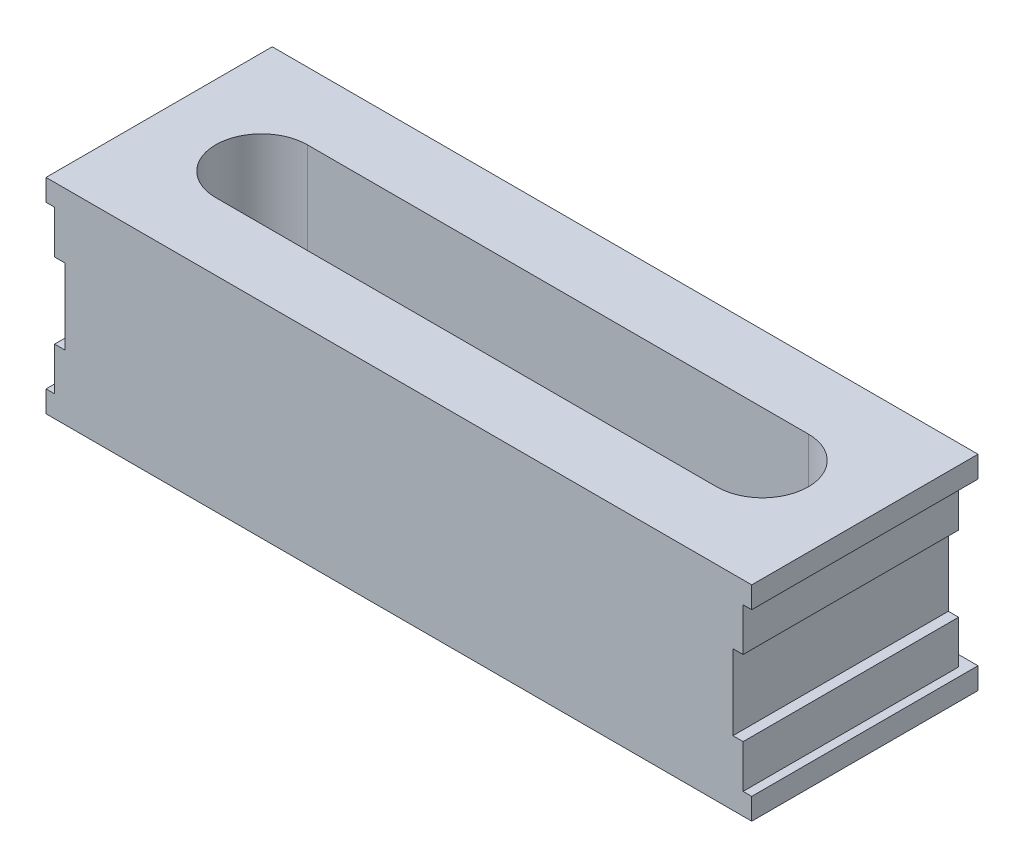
ISO-10303-21;
HEADER;
FILE_DESCRIPTION(('STEP AP214'),'2;1');
FILE_NAME('part.step','',(''),(''),'','','');
FILE_SCHEMA(('AUTOMOTIVE_DESIGN { 1 0 10303 214 1 1 1 1 }'));
ENDSEC;
DATA;
#1=APPLICATION_CONTEXT('core data for automotive mechanical design processes');
#2=APPLICATION_PROTOCOL_DEFINITION('international standard','automotive_design',2000,#1);
#3=PRODUCT_CONTEXT('',#1,'mechanical');
#4=PRODUCT('Part','Part','',(#3));
#5=PRODUCT_RELATED_PRODUCT_CATEGORY('part','',(#4));
#6=PRODUCT_DEFINITION_FORMATION('','',#4);
#7=PRODUCT_DEFINITION_CONTEXT('part definition',#1,'design');
#8=PRODUCT_DEFINITION('design','',#6,#7);
#9=PRODUCT_DEFINITION_SHAPE('','',#8);
#10=(LENGTH_UNIT() NAMED_UNIT(*) SI_UNIT(.MILLI.,.METRE.));
#11=(NAMED_UNIT(*) PLANE_ANGLE_UNIT() SI_UNIT($,.RADIAN.));
#12=(NAMED_UNIT(*) SI_UNIT($,.STERADIAN.) SOLID_ANGLE_UNIT());
#13=UNCERTAINTY_MEASURE_WITH_UNIT(LENGTH_MEASURE(1.E-05),#10,'distance_accuracy_value','');
#14=(GEOMETRIC_REPRESENTATION_CONTEXT(3) GLOBAL_UNCERTAINTY_ASSIGNED_CONTEXT((#13)) GLOBAL_UNIT_ASSIGNED_CONTEXT((#10,
#11,#12)) REPRESENTATION_CONTEXT('',''));
#15=CARTESIAN_POINT('',(0.,0.,0.));
#16=DIRECTION('',(0.,0.,1.));
#17=DIRECTION('',(1.,0.,0.));
#18=AXIS2_PLACEMENT_3D('',#15,#16,#17);
#19=CARTESIAN_POINT('',(-23.25,-8.5,0.));
#20=DIRECTION('',(0.,-1.,0.));
#21=DIRECTION('',(0.,0.,-1.));
#22=AXIS2_PLACEMENT_3D('',#19,#20,#21);
#23=PLANE('',#22);
#24=CARTESIAN_POINT('',(-23.25,-8.5,0.));
#25=DIRECTION('',(0.,-1.,0.));
#26=DIRECTION('',(0.,0.,-1.));
#27=AXIS2_PLACEMENT_3D('',#24,#25,#26);
#28=CIRCLE('',#27,4.25);
#29=CARTESIAN_POINT('',(-23.25,-8.5,4.25));
#30=VERTEX_POINT('',#29);
#31=CARTESIAN_POINT('',(-23.25,-8.5,-4.25));
#32=VERTEX_POINT('',#31);
#33=EDGE_CURVE('E227',#30,#32,#28,.T.);
#34=ORIENTED_EDGE('',*,*,#33,.F.);
#35=DIRECTION('',(-1.,0.,0.));
#36=VECTOR('',#35,1.);
#37=CARTESIAN_POINT('',(-23.25,-8.5,4.25));
#38=LINE('',#37,#36);
#39=CARTESIAN_POINT('',(23.25,-8.5,4.25));
#40=VERTEX_POINT('',#39);
#41=EDGE_CURVE('E222',#40,#30,#38,.T.);
#42=ORIENTED_EDGE('',*,*,#41,.F.);
#43=CARTESIAN_POINT('',(23.25,-8.5,0.));
#44=DIRECTION('',(0.,-1.,0.));
#45=DIRECTION('',(0.,0.,-1.));
#46=AXIS2_PLACEMENT_3D('',#43,#44,#45);
#47=CIRCLE('',#46,4.25);
#48=CARTESIAN_POINT('',(23.25,-8.5,-4.25));
#49=VERTEX_POINT('',#48);
#50=EDGE_CURVE('E24',#49,#40,#47,.T.);
#51=ORIENTED_EDGE('',*,*,#50,.F.);
#52=DIRECTION('',(1.,0.,0.));
#53=VECTOR('',#52,1.);
#54=CARTESIAN_POINT('',(-23.25,-8.5,-4.25));
#55=LINE('',#54,#53);
#56=EDGE_CURVE('E9',#32,#49,#55,.T.);
#57=ORIENTED_EDGE('',*,*,#56,.F.);
#58=EDGE_LOOP('',(#34,#42,#51,#57));
#59=FACE_BOUND('',#58,.T.);
#60=ADVANCED_FACE('F15',(#59),#23,.F.);
#61=CARTESIAN_POINT('',(-23.25,11.5,-4.25));
#62=DIRECTION('',(0.,0.,-1.));
#63=DIRECTION('',(0.,-1.,0.));
#64=AXIS2_PLACEMENT_3D('',#61,#62,#63);
#65=PLANE('',#64);
#66=DIRECTION('',(0.,-1.,0.));
#67=VECTOR('',#66,1.);
#68=CARTESIAN_POINT('',(-23.25,11.5,-4.25));
#69=LINE('',#68,#67);
#70=CARTESIAN_POINT('',(-23.25,9.5,-4.25));
#71=VERTEX_POINT('',#70);
#72=EDGE_CURVE('E231',#71,#32,#69,.T.);
#73=ORIENTED_EDGE('',*,*,#72,.T.);
#74=ORIENTED_EDGE('',*,*,#56,.T.);
#75=DIRECTION('',(0.,-1.,0.));
#76=VECTOR('',#75,1.);
#77=CARTESIAN_POINT('',(23.25,11.5,-4.25));
#78=LINE('',#77,#76);
#79=CARTESIAN_POINT('',(23.25,9.5,-4.25));
#80=VERTEX_POINT('',#79);
#81=EDGE_CURVE('E255',#80,#49,#78,.T.);
#82=ORIENTED_EDGE('',*,*,#81,.F.);
#83=DIRECTION('',(1.,0.,0.));
#84=VECTOR('',#83,1.);
#85=CARTESIAN_POINT('',(-32.75,9.5,-4.25));
#86=LINE('',#85,#84);
#87=EDGE_CURVE('E234',#71,#80,#86,.T.);
#88=ORIENTED_EDGE('',*,*,#87,.F.);
#89=EDGE_LOOP('',(#73,#74,#82,#88));
#90=FACE_BOUND('',#89,.T.);
#91=ADVANCED_FACE('F232',(#90),#65,.F.);
#92=CARTESIAN_POINT('',(23.25,11.5,0.));
#93=DIRECTION('',(0.,-1.,0.));
#94=DIRECTION('',(0.,0.,-1.));
#95=AXIS2_PLACEMENT_3D('',#92,#93,#94);
#96=CYLINDRICAL_SURFACE('',#95,4.25);
#97=ORIENTED_EDGE('',*,*,#81,.T.);
#98=ORIENTED_EDGE('',*,*,#50,.T.);
#99=DIRECTION('',(0.,-1.,0.));
#100=VECTOR('',#99,1.);
#101=CARTESIAN_POINT('',(23.25,11.5,4.25));
#102=LINE('',#101,#100);
#103=CARTESIAN_POINT('',(23.25,9.5,4.25));
#104=VERTEX_POINT('',#103);
#105=EDGE_CURVE('E239',#104,#40,#102,.T.);
#106=ORIENTED_EDGE('',*,*,#105,.F.);
#107=CARTESIAN_POINT('',(23.25,9.5,0.));
#108=DIRECTION('',(0.,-1.,0.));
#109=DIRECTION('',(0.,0.,-1.));
#110=AXIS2_PLACEMENT_3D('',#107,#108,#109);
#111=CIRCLE('',#110,4.25);
#112=EDGE_CURVE('E248',#80,#104,#111,.T.);
#113=ORIENTED_EDGE('',*,*,#112,.F.);
#114=EDGE_LOOP('',(#97,#98,#106,#113));
#115=FACE_BOUND('',#114,.T.);
#116=ADVANCED_FACE('F260',(#115),#96,.F.);
#117=CARTESIAN_POINT('',(-23.25,11.5,4.25));
#118=DIRECTION('',(0.,0.,1.));
#119=DIRECTION('',(1.,0.,0.));
#120=AXIS2_PLACEMENT_3D('',#117,#118,#119);
#121=PLANE('',#120);
#122=ORIENTED_EDGE('',*,*,#105,.T.);
#123=ORIENTED_EDGE('',*,*,#41,.T.);
#124=DIRECTION('',(0.,-1.,0.));
#125=VECTOR('',#124,1.);
#126=CARTESIAN_POINT('',(-23.25,11.5,4.25));
#127=LINE('',#126,#125);
#128=CARTESIAN_POINT('',(-23.25,9.5,4.25));
#129=VERTEX_POINT('',#128);
#130=EDGE_CURVE('E242',#129,#30,#127,.T.);
#131=ORIENTED_EDGE('',*,*,#130,.F.);
#132=DIRECTION('',(-1.,0.,0.));
#133=VECTOR('',#132,1.);
#134=CARTESIAN_POINT('',(-32.75,9.5,4.25));
#135=LINE('',#134,#133);
#136=EDGE_CURVE('E266',#104,#129,#135,.T.);
#137=ORIENTED_EDGE('',*,*,#136,.F.);
#138=EDGE_LOOP('',(#122,#123,#131,#137));
#139=FACE_BOUND('',#138,.T.);
#140=ADVANCED_FACE('F264',(#139),#121,.F.);
#141=CARTESIAN_POINT('',(-23.25,11.5,0.));
#142=DIRECTION('',(0.,-1.,0.));
#143=DIRECTION('',(0.,0.,-1.));
#144=AXIS2_PLACEMENT_3D('',#141,#142,#143);
#145=CYLINDRICAL_SURFACE('',#144,4.25);
#146=ORIENTED_EDGE('',*,*,#130,.T.);
#147=ORIENTED_EDGE('',*,*,#33,.T.);
#148=ORIENTED_EDGE('',*,*,#72,.F.);
#149=CARTESIAN_POINT('',(-23.25,9.5,0.));
#150=DIRECTION('',(0.,-1.,0.));
#151=DIRECTION('',(0.,0.,-1.));
#152=AXIS2_PLACEMENT_3D('',#149,#150,#151);
#153=CIRCLE('',#152,4.25);
#154=EDGE_CURVE('E269',#129,#71,#153,.T.);
#155=ORIENTED_EDGE('',*,*,#154,.F.);
#156=EDGE_LOOP('',(#146,#147,#148,#155));
#157=FACE_BOUND('',#156,.T.);
#158=ADVANCED_FACE('F241',(#157),#145,.F.);
#159=CARTESIAN_POINT('',(-32.75,9.5,10.5));
#160=DIRECTION('',(0.,-1.,0.));
#161=DIRECTION('',(0.,0.,-1.));
#162=AXIS2_PLACEMENT_3D('',#159,#160,#161);
#163=PLANE('',#162);
#164=ORIENTED_EDGE('',*,*,#136,.T.);
#165=ORIENTED_EDGE('',*,*,#154,.T.);
#166=ORIENTED_EDGE('',*,*,#87,.T.);
#167=ORIENTED_EDGE('',*,*,#112,.T.);
#168=EDGE_LOOP('',(#164,#165,#166,#167));
#169=FACE_BOUND('',#168,.T.);
#170=DIRECTION('',(0.,0.,-1.));
#171=VECTOR('',#170,1.);
#172=CARTESIAN_POINT('',(32.75,9.5,10.5));
#173=LINE('',#172,#171);
#174=CARTESIAN_POINT('',(32.75,9.5,10.5));
#175=VERTEX_POINT('',#174);
#176=CARTESIAN_POINT('',(32.75,9.5,-10.5));
#177=VERTEX_POINT('',#176);
#178=EDGE_CURVE('E270',#175,#177,#173,.T.);
#179=ORIENTED_EDGE('',*,*,#178,.T.);
#180=DIRECTION('',(-1.,0.,0.));
#181=VECTOR('',#180,1.);
#182=CARTESIAN_POINT('',(-32.75,9.5,-10.5));
#183=LINE('',#182,#181);
#184=CARTESIAN_POINT('',(-32.75,9.5,-10.5));
#185=VERTEX_POINT('',#184);
#186=EDGE_CURVE('E291',#177,#185,#183,.T.);
#187=ORIENTED_EDGE('',*,*,#186,.T.);
#188=DIRECTION('',(0.,0.,-1.));
#189=VECTOR('',#188,1.);
#190=CARTESIAN_POINT('',(-32.75,9.5,10.5));
#191=LINE('',#190,#189);
#192=CARTESIAN_POINT('',(-32.75,9.5,10.5));
#193=VERTEX_POINT('',#192);
#194=EDGE_CURVE('E310',#193,#185,#191,.T.);
#195=ORIENTED_EDGE('',*,*,#194,.F.);
#196=DIRECTION('',(-1.,0.,0.));
#197=VECTOR('',#196,1.);
#198=CARTESIAN_POINT('',(-32.75,9.5,10.5));
#199=LINE('',#198,#197);
#200=EDGE_CURVE('E404',#175,#193,#199,.T.);
#201=ORIENTED_EDGE('',*,*,#200,.F.);
#202=EDGE_LOOP('',(#179,#187,#195,#201));
#203=FACE_BOUND('',#202,.T.);
#204=ADVANCED_FACE('F604',(#169,#203),#163,.F.);
#205=CARTESIAN_POINT('',(32.75,9.5,10.5));
#206=DIRECTION('',(-1.,0.,0.));
#207=DIRECTION('',(0.,0.,1.));
#208=AXIS2_PLACEMENT_3D('',#205,#206,#207);
#209=PLANE('',#208);
#210=DIRECTION('',(0.,1.,0.));
#211=VECTOR('',#210,1.);
#212=CARTESIAN_POINT('',(32.75,9.5,-10.5));
#213=LINE('',#212,#211);
#214=CARTESIAN_POINT('',(32.75,-9.5,-10.5));
#215=VERTEX_POINT('',#214);
#216=CARTESIAN_POINT('',(32.75,-7.5,-10.5));
#217=VERTEX_POINT('',#216);
#218=EDGE_CURVE('E276',#215,#217,#213,.T.);
#219=ORIENTED_EDGE('',*,*,#218,.T.);
#220=DIRECTION('',(0.,0.,1.));
#221=VECTOR('',#220,1.);
#222=CARTESIAN_POINT('',(32.75,-7.5,-11.5));
#223=LINE('',#222,#221);
#224=CARTESIAN_POINT('',(32.75,-7.5,10.5));
#225=VERTEX_POINT('',#224);
#226=EDGE_CURVE('E491',#217,#225,#223,.T.);
#227=ORIENTED_EDGE('',*,*,#226,.T.);
#228=DIRECTION('',(0.,1.,0.));
#229=VECTOR('',#228,1.);
#230=CARTESIAN_POINT('',(32.75,9.5,10.5));
#231=LINE('',#230,#229);
#232=CARTESIAN_POINT('',(32.75,-9.5,10.5));
#233=VERTEX_POINT('',#232);
#234=EDGE_CURVE('E349',#233,#225,#231,.T.);
#235=ORIENTED_EDGE('',*,*,#234,.F.);
#236=DIRECTION('',(0.,0.,-1.));
#237=VECTOR('',#236,1.);
#238=CARTESIAN_POINT('',(32.75,-9.5,10.5));
#239=LINE('',#238,#237);
#240=EDGE_CURVE('E288',#233,#215,#239,.T.);
#241=ORIENTED_EDGE('',*,*,#240,.T.);
#242=EDGE_LOOP('',(#219,#227,#235,#241));
#243=FACE_BOUND('',#242,.T.);
#244=ADVANCED_FACE('F346',(#243),#209,.F.);
#245=CARTESIAN_POINT('',(32.75,9.5,10.5));
#246=DIRECTION('',(-1.,0.,0.));
#247=DIRECTION('',(0.,0.,1.));
#248=AXIS2_PLACEMENT_3D('',#245,#246,#247);
#249=PLANE('',#248);
#250=DIRECTION('',(0.,1.,0.));
#251=VECTOR('',#250,1.);
#252=CARTESIAN_POINT('',(32.75,9.5,10.5));
#253=LINE('',#252,#251);
#254=CARTESIAN_POINT('',(32.75,7.5,10.5));
#255=VERTEX_POINT('',#254);
#256=EDGE_CURVE('E388',#255,#175,#253,.T.);
#257=ORIENTED_EDGE('',*,*,#256,.F.);
#258=DIRECTION('',(0.,0.,1.));
#259=VECTOR('',#258,1.);
#260=CARTESIAN_POINT('',(32.75,7.5,-11.5));
#261=LINE('',#260,#259);
#262=CARTESIAN_POINT('',(32.75,7.5,-10.5));
#263=VERTEX_POINT('',#262);
#264=EDGE_CURVE('E331',#263,#255,#261,.T.);
#265=ORIENTED_EDGE('',*,*,#264,.F.);
#266=DIRECTION('',(0.,1.,0.));
#267=VECTOR('',#266,1.);
#268=CARTESIAN_POINT('',(32.75,9.5,-10.5));
#269=LINE('',#268,#267);
#270=EDGE_CURVE('E295',#263,#177,#269,.T.);
#271=ORIENTED_EDGE('',*,*,#270,.T.);
#272=ORIENTED_EDGE('',*,*,#178,.F.);
#273=EDGE_LOOP('',(#257,#265,#271,#272));
#274=FACE_BOUND('',#273,.T.);
#275=ADVANCED_FACE('F609',(#274),#249,.F.);
#276=CARTESIAN_POINT('',(-32.75,-9.5,-10.5));
#277=DIRECTION('',(0.,0.,1.));
#278=DIRECTION('',(1.,0.,0.));
#279=AXIS2_PLACEMENT_3D('',#276,#277,#278);
#280=PLANE('',#279);
#281=DIRECTION('',(0.,-1.,0.));
#282=VECTOR('',#281,1.);
#283=CARTESIAN_POINT('',(-32.75,9.5,-10.5));
#284=LINE('',#283,#282);
#285=CARTESIAN_POINT('',(-32.75,-7.5,-10.5));
#286=VERTEX_POINT('',#285);
#287=CARTESIAN_POINT('',(-32.75,-9.5,-10.5));
#288=VERTEX_POINT('',#287);
#289=EDGE_CURVE('E308',#286,#288,#284,.T.);
#290=ORIENTED_EDGE('',*,*,#289,.F.);
#291=DIRECTION('',(1.,0.,0.));
#292=VECTOR('',#291,1.);
#293=CARTESIAN_POINT('',(-32.75,-7.5,-10.5));
#294=LINE('',#293,#292);
#295=EDGE_CURVE('E496',#286,#217,#294,.T.);
#296=ORIENTED_EDGE('',*,*,#295,.T.);
#297=ORIENTED_EDGE('',*,*,#218,.F.);
#298=DIRECTION('',(1.,0.,0.));
#299=VECTOR('',#298,1.);
#300=CARTESIAN_POINT('',(-32.75,-9.5,-10.5));
#301=LINE('',#300,#299);
#302=EDGE_CURVE('E335',#288,#215,#301,.T.);
#303=ORIENTED_EDGE('',*,*,#302,.F.);
#304=EDGE_LOOP('',(#290,#296,#297,#303));
#305=FACE_BOUND('',#304,.T.);
#306=ADVANCED_FACE('F587',(#305),#280,.F.);
#307=CARTESIAN_POINT('',(-32.75,9.5,10.5));
#308=DIRECTION('',(1.,0.,0.));
#309=DIRECTION('',(0.,1.,0.));
#310=AXIS2_PLACEMENT_3D('',#307,#308,#309);
#311=PLANE('',#310);
#312=DIRECTION('',(0.,0.,1.));
#313=VECTOR('',#312,1.);
#314=CARTESIAN_POINT('',(-32.75,7.5,-11.5));
#315=LINE('',#314,#313);
#316=CARTESIAN_POINT('',(-32.75,7.5,-10.5));
#317=VERTEX_POINT('',#316);
#318=CARTESIAN_POINT('',(-32.75,7.5,10.5));
#319=VERTEX_POINT('',#318);
#320=EDGE_CURVE('E505',#317,#319,#315,.T.);
#321=ORIENTED_EDGE('',*,*,#320,.T.);
#322=DIRECTION('',(0.,-1.,0.));
#323=VECTOR('',#322,1.);
#324=CARTESIAN_POINT('',(-32.75,9.5,10.5));
#325=LINE('',#324,#323);
#326=EDGE_CURVE('E423',#193,#319,#325,.T.);
#327=ORIENTED_EDGE('',*,*,#326,.F.);
#328=ORIENTED_EDGE('',*,*,#194,.T.);
#329=DIRECTION('',(0.,-1.,0.));
#330=VECTOR('',#329,1.);
#331=CARTESIAN_POINT('',(-32.75,9.5,-10.5));
#332=LINE('',#331,#330);
#333=EDGE_CURVE('E289',#185,#317,#332,.T.);
#334=ORIENTED_EDGE('',*,*,#333,.T.);
#335=EDGE_LOOP('',(#321,#327,#328,#334));
#336=FACE_BOUND('',#335,.T.);
#337=ADVANCED_FACE('F579',(#336),#311,.F.);
#338=CARTESIAN_POINT('',(-32.75,9.5,10.5));
#339=DIRECTION('',(1.,0.,0.));
#340=DIRECTION('',(0.,1.,0.));
#341=AXIS2_PLACEMENT_3D('',#338,#339,#340);
#342=PLANE('',#341);
#343=DIRECTION('',(0.,0.,1.));
#344=VECTOR('',#343,1.);
#345=CARTESIAN_POINT('',(-32.75,-7.5,-11.5));
#346=LINE('',#345,#344);
#347=CARTESIAN_POINT('',(-32.75,-7.5,10.5));
#348=VERTEX_POINT('',#347);
#349=EDGE_CURVE('E499',#286,#348,#346,.T.);
#350=ORIENTED_EDGE('',*,*,#349,.F.);
#351=ORIENTED_EDGE('',*,*,#289,.T.);
#352=DIRECTION('',(0.,0.,-1.));
#353=VECTOR('',#352,1.);
#354=CARTESIAN_POINT('',(-32.75,-9.5,10.5));
#355=LINE('',#354,#353);
#356=CARTESIAN_POINT('',(-32.75,-9.5,10.5));
#357=VERTEX_POINT('',#356);
#358=EDGE_CURVE('E333',#357,#288,#355,.T.);
#359=ORIENTED_EDGE('',*,*,#358,.F.);
#360=DIRECTION('',(0.,-1.,0.));
#361=VECTOR('',#360,1.);
#362=CARTESIAN_POINT('',(-32.75,9.5,10.5));
#363=LINE('',#362,#361);
#364=EDGE_CURVE('E357',#348,#357,#363,.T.);
#365=ORIENTED_EDGE('',*,*,#364,.F.);
#366=EDGE_LOOP('',(#350,#351,#359,#365));
#367=FACE_BOUND('',#366,.T.);
#368=ADVANCED_FACE('F577',(#367),#342,.F.);
#369=CARTESIAN_POINT('',(-31.95,-5.5,-11.5));
#370=DIRECTION('',(-1.,0.,0.));
#371=DIRECTION('',(0.,0.,1.));
#372=AXIS2_PLACEMENT_3D('',#369,#370,#371);
#373=PLANE('',#372);
#374=DIRECTION('',(0.,0.,1.));
#375=VECTOR('',#374,1.);
#376=CARTESIAN_POINT('',(-31.95,-3.5,-11.5));
#377=LINE('',#376,#375);
#378=CARTESIAN_POINT('',(-31.95,-3.5,-9.5));
#379=VERTEX_POINT('',#378);
#380=CARTESIAN_POINT('',(-31.95,-3.5,10.5));
#381=VERTEX_POINT('',#380);
#382=EDGE_CURVE('E311',#379,#381,#377,.T.);
#383=ORIENTED_EDGE('',*,*,#382,.F.);
#384=DIRECTION('',(0.,-1.,0.));
#385=VECTOR('',#384,1.);
#386=CARTESIAN_POINT('',(-31.95,-5.5,-9.5));
#387=LINE('',#386,#385);
#388=CARTESIAN_POINT('',(-31.95,-7.5,-9.5));
#389=VERTEX_POINT('',#388);
#390=EDGE_CURVE('E478',#379,#389,#387,.T.);
#391=ORIENTED_EDGE('',*,*,#390,.T.);
#392=DIRECTION('',(0.,0.,-1.));
#393=VECTOR('',#392,1.);
#394=CARTESIAN_POINT('',(-31.95,-7.5,10.5));
#395=LINE('',#394,#393);
#396=CARTESIAN_POINT('',(-31.95,-7.5,10.5));
#397=VERTEX_POINT('',#396);
#398=EDGE_CURVE('E485',#397,#389,#395,.T.);
#399=ORIENTED_EDGE('',*,*,#398,.F.);
#400=DIRECTION('',(0.,-1.,0.));
#401=VECTOR('',#400,1.);
#402=CARTESIAN_POINT('',(-31.95,-5.5,10.5));
#403=LINE('',#402,#401);
#404=EDGE_CURVE('E372',#381,#397,#403,.T.);
#405=ORIENTED_EDGE('',*,*,#404,.F.);
#406=EDGE_LOOP('',(#383,#391,#399,#405));
#407=FACE_BOUND('',#406,.T.);
#408=ADVANCED_FACE('F576',(#407),#373,.T.);
#409=CARTESIAN_POINT('',(-31.95,-3.5,-11.5));
#410=DIRECTION('',(0.,1.,0.));
#411=DIRECTION('',(1.,0.,0.));
#412=AXIS2_PLACEMENT_3D('',#409,#410,#411);
#413=PLANE('',#412);
#414=DIRECTION('',(-1.,0.,0.));
#415=VECTOR('',#414,1.);
#416=CARTESIAN_POINT('',(-31.95,-3.5,10.5));
#417=LINE('',#416,#415);
#418=CARTESIAN_POINT('',(-31.,-3.5,10.5));
#419=VERTEX_POINT('',#418);
#420=EDGE_CURVE('E380',#419,#381,#417,.T.);
#421=ORIENTED_EDGE('',*,*,#420,.F.);
#422=DIRECTION('',(0.,0.,1.));
#423=VECTOR('',#422,1.);
#424=CARTESIAN_POINT('',(-31.,-3.5,-10.5));
#425=LINE('',#424,#423);
#426=CARTESIAN_POINT('',(-31.,-3.5,-9.5));
#427=VERTEX_POINT('',#426);
#428=EDGE_CURVE('E307',#427,#419,#425,.T.);
#429=ORIENTED_EDGE('',*,*,#428,.F.);
#430=DIRECTION('',(-1.,0.,0.));
#431=VECTOR('',#430,1.);
#432=CARTESIAN_POINT('',(-31.95,-3.5,-9.5));
#433=LINE('',#432,#431);
#434=EDGE_CURVE('E482',#427,#379,#433,.T.);
#435=ORIENTED_EDGE('',*,*,#434,.T.);
#436=ORIENTED_EDGE('',*,*,#382,.T.);
#437=EDGE_LOOP('',(#421,#429,#435,#436));
#438=FACE_BOUND('',#437,.T.);
#439=ADVANCED_FACE('F574',(#438),#413,.T.);
#440=CARTESIAN_POINT('',(-31.,1.75,-11.5));
#441=DIRECTION('',(-1.,0.,0.));
#442=DIRECTION('',(0.,0.,1.));
#443=AXIS2_PLACEMENT_3D('',#440,#441,#442);
#444=PLANE('',#443);
#445=DIRECTION('',(0.,-1.,0.));
#446=VECTOR('',#445,1.);
#447=CARTESIAN_POINT('',(-31.,1.75,10.5));
#448=LINE('',#447,#446);
#449=CARTESIAN_POINT('',(-31.,3.5,10.5));
#450=VERTEX_POINT('',#449);
#451=EDGE_CURVE('E377',#450,#419,#448,.T.);
#452=ORIENTED_EDGE('',*,*,#451,.F.);
#453=DIRECTION('',(0.,0.,1.));
#454=VECTOR('',#453,1.);
#455=CARTESIAN_POINT('',(-31.,3.5,-10.5));
#456=LINE('',#455,#454);
#457=CARTESIAN_POINT('',(-31.,3.5,-9.5));
#458=VERTEX_POINT('',#457);
#459=EDGE_CURVE('E305',#458,#450,#456,.T.);
#460=ORIENTED_EDGE('',*,*,#459,.F.);
#461=DIRECTION('',(0.,-1.,0.));
#462=VECTOR('',#461,1.);
#463=CARTESIAN_POINT('',(-31.,1.75,-9.5));
#464=LINE('',#463,#462);
#465=EDGE_CURVE('E435',#458,#427,#464,.T.);
#466=ORIENTED_EDGE('',*,*,#465,.T.);
#467=ORIENTED_EDGE('',*,*,#428,.T.);
#468=EDGE_LOOP('',(#452,#460,#466,#467));
#469=FACE_BOUND('',#468,.T.);
#470=ADVANCED_FACE('F572',(#469),#444,.T.);
#471=CARTESIAN_POINT('',(-31.95,3.5,-11.5));
#472=DIRECTION('',(0.,-1.,0.));
#473=DIRECTION('',(0.,0.,-1.));
#474=AXIS2_PLACEMENT_3D('',#471,#472,#473);
#475=PLANE('',#474);
#476=DIRECTION('',(0.,0.,1.));
#477=VECTOR('',#476,1.);
#478=CARTESIAN_POINT('',(-31.95,3.5,-11.5));
#479=LINE('',#478,#477);
#480=CARTESIAN_POINT('',(-31.95,3.5,-9.5));
#481=VERTEX_POINT('',#480);
#482=CARTESIAN_POINT('',(-31.95,3.5,10.5));
#483=VERTEX_POINT('',#482);
#484=EDGE_CURVE('E303',#481,#483,#479,.T.);
#485=ORIENTED_EDGE('',*,*,#484,.F.);
#486=DIRECTION('',(1.,0.,0.));
#487=VECTOR('',#486,1.);
#488=CARTESIAN_POINT('',(-31.95,3.5,-9.5));
#489=LINE('',#488,#487);
#490=EDGE_CURVE('E439',#481,#458,#489,.T.);
#491=ORIENTED_EDGE('',*,*,#490,.T.);
#492=ORIENTED_EDGE('',*,*,#459,.T.);
#493=DIRECTION('',(1.,0.,0.));
#494=VECTOR('',#493,1.);
#495=CARTESIAN_POINT('',(-31.95,3.5,10.5));
#496=LINE('',#495,#494);
#497=EDGE_CURVE('E381',#483,#450,#496,.T.);
#498=ORIENTED_EDGE('',*,*,#497,.F.);
#499=EDGE_LOOP('',(#485,#491,#492,#498));
#500=FACE_BOUND('',#499,.T.);
#501=ADVANCED_FACE('F569',(#500),#475,.T.);
#502=CARTESIAN_POINT('',(-31.95,5.5,-11.5));
#503=DIRECTION('',(-1.,0.,0.));
#504=DIRECTION('',(0.,0.,1.));
#505=AXIS2_PLACEMENT_3D('',#502,#503,#504);
#506=PLANE('',#505);
#507=DIRECTION('',(0.,-1.,0.));
#508=VECTOR('',#507,1.);
#509=CARTESIAN_POINT('',(-31.95,5.5,10.5));
#510=LINE('',#509,#508);
#511=CARTESIAN_POINT('',(-31.95,7.5,10.5));
#512=VERTEX_POINT('',#511);
#513=EDGE_CURVE('E431',#512,#483,#510,.T.);
#514=ORIENTED_EDGE('',*,*,#513,.F.);
#515=DIRECTION('',(0.,0.,1.));
#516=VECTOR('',#515,1.);
#517=CARTESIAN_POINT('',(-31.95,7.5,10.5));
#518=LINE('',#517,#516);
#519=CARTESIAN_POINT('',(-31.95,7.5,-9.5));
#520=VERTEX_POINT('',#519);
#521=EDGE_CURVE('E502',#520,#512,#518,.T.);
#522=ORIENTED_EDGE('',*,*,#521,.F.);
#523=DIRECTION('',(0.,-1.,0.));
#524=VECTOR('',#523,1.);
#525=CARTESIAN_POINT('',(-31.95,5.5,-9.5));
#526=LINE('',#525,#524);
#527=EDGE_CURVE('E443',#520,#481,#526,.T.);
#528=ORIENTED_EDGE('',*,*,#527,.T.);
#529=ORIENTED_EDGE('',*,*,#484,.T.);
#530=EDGE_LOOP('',(#514,#522,#528,#529));
#531=FACE_BOUND('',#530,.T.);
#532=ADVANCED_FACE('F668',(#531),#506,.T.);
#533=CARTESIAN_POINT('',(31.95,5.5,-11.5));
#534=DIRECTION('',(-1.,0.,0.));
#535=DIRECTION('',(0.,0.,1.));
#536=AXIS2_PLACEMENT_3D('',#533,#534,#535);
#537=PLANE('',#536);
#538=DIRECTION('',(0.,-1.,0.));
#539=VECTOR('',#538,1.);
#540=CARTESIAN_POINT('',(31.95,5.5,-9.5));
#541=LINE('',#540,#539);
#542=CARTESIAN_POINT('',(31.95,7.5,-9.5));
#543=VERTEX_POINT('',#542);
#544=CARTESIAN_POINT('',(31.95,3.5,-9.5));
#545=VERTEX_POINT('',#544);
#546=EDGE_CURVE('E451',#543,#545,#541,.T.);
#547=ORIENTED_EDGE('',*,*,#546,.F.);
#548=DIRECTION('',(0.,0.,1.));
#549=VECTOR('',#548,1.);
#550=CARTESIAN_POINT('',(31.95,7.5,10.5));
#551=LINE('',#550,#549);
#552=CARTESIAN_POINT('',(31.95,7.5,10.5));
#553=VERTEX_POINT('',#552);
#554=EDGE_CURVE('E336',#543,#553,#551,.T.);
#555=ORIENTED_EDGE('',*,*,#554,.T.);
#556=DIRECTION('',(0.,-1.,0.));
#557=VECTOR('',#556,1.);
#558=CARTESIAN_POINT('',(31.95,5.5,10.5));
#559=LINE('',#558,#557);
#560=CARTESIAN_POINT('',(31.95,3.5,10.5));
#561=VERTEX_POINT('',#560);
#562=EDGE_CURVE('E389',#553,#561,#559,.T.);
#563=ORIENTED_EDGE('',*,*,#562,.T.);
#564=DIRECTION('',(0.,0.,1.));
#565=VECTOR('',#564,1.);
#566=CARTESIAN_POINT('',(31.95,3.5,-11.5));
#567=LINE('',#566,#565);
#568=EDGE_CURVE('E300',#545,#561,#567,.T.);
#569=ORIENTED_EDGE('',*,*,#568,.F.);
#570=EDGE_LOOP('',(#547,#555,#563,#569));
#571=FACE_BOUND('',#570,.T.);
#572=ADVANCED_FACE('F558',(#571),#537,.F.);
#573=CARTESIAN_POINT('',(31.95,3.5,-11.5));
#574=DIRECTION('',(0.,1.,0.));
#575=DIRECTION('',(1.,0.,0.));
#576=AXIS2_PLACEMENT_3D('',#573,#574,#575);
#577=PLANE('',#576);
#578=DIRECTION('',(-1.,0.,0.));
#579=VECTOR('',#578,1.);
#580=CARTESIAN_POINT('',(31.95,3.5,-9.5));
#581=LINE('',#580,#579);
#582=CARTESIAN_POINT('',(31.,3.5,-9.5));
#583=VERTEX_POINT('',#582);
#584=EDGE_CURVE('E455',#545,#583,#581,.T.);
#585=ORIENTED_EDGE('',*,*,#584,.F.);
#586=ORIENTED_EDGE('',*,*,#568,.T.);
#587=DIRECTION('',(-1.,0.,0.));
#588=VECTOR('',#587,1.);
#589=CARTESIAN_POINT('',(31.95,3.5,10.5));
#590=LINE('',#589,#588);
#591=CARTESIAN_POINT('',(31.,3.5,10.5));
#592=VERTEX_POINT('',#591);
#593=EDGE_CURVE('E408',#561,#592,#590,.T.);
#594=ORIENTED_EDGE('',*,*,#593,.T.);
#595=DIRECTION('',(0.,0.,1.));
#596=VECTOR('',#595,1.);
#597=CARTESIAN_POINT('',(31.,3.5,-10.5));
#598=LINE('',#597,#596);
#599=EDGE_CURVE('E304',#583,#592,#598,.T.);
#600=ORIENTED_EDGE('',*,*,#599,.F.);
#601=EDGE_LOOP('',(#585,#586,#594,#600));
#602=FACE_BOUND('',#601,.T.);
#603=ADVANCED_FACE('F557',(#602),#577,.F.);
#604=CARTESIAN_POINT('',(31.,1.75,-11.5));
#605=DIRECTION('',(-1.,0.,0.));
#606=DIRECTION('',(0.,0.,1.));
#607=AXIS2_PLACEMENT_3D('',#604,#605,#606);
#608=PLANE('',#607);
#609=DIRECTION('',(0.,-1.,0.));
#610=VECTOR('',#609,1.);
#611=CARTESIAN_POINT('',(31.,1.75,-9.5));
#612=LINE('',#611,#610);
#613=CARTESIAN_POINT('',(31.,-3.5,-9.5));
#614=VERTEX_POINT('',#613);
#615=EDGE_CURVE('E462',#583,#614,#612,.T.);
#616=ORIENTED_EDGE('',*,*,#615,.F.);
#617=ORIENTED_EDGE('',*,*,#599,.T.);
#618=DIRECTION('',(0.,-1.,0.));
#619=VECTOR('',#618,1.);
#620=CARTESIAN_POINT('',(31.,1.75,10.5));
#621=LINE('',#620,#619);
#622=CARTESIAN_POINT('',(31.,-3.5,10.5));
#623=VERTEX_POINT('',#622);
#624=EDGE_CURVE('E394',#592,#623,#621,.T.);
#625=ORIENTED_EDGE('',*,*,#624,.T.);
#626=DIRECTION('',(0.,0.,1.));
#627=VECTOR('',#626,1.);
#628=CARTESIAN_POINT('',(31.,-3.5,-10.5));
#629=LINE('',#628,#627);
#630=EDGE_CURVE('E458',#614,#623,#629,.T.);
#631=ORIENTED_EDGE('',*,*,#630,.F.);
#632=EDGE_LOOP('',(#616,#617,#625,#631));
#633=FACE_BOUND('',#632,.T.);
#634=ADVANCED_FACE('F554',(#633),#608,.F.);
#635=CARTESIAN_POINT('',(31.95,-3.5,-11.5));
#636=DIRECTION('',(0.,-1.,0.));
#637=DIRECTION('',(0.,0.,-1.));
#638=AXIS2_PLACEMENT_3D('',#635,#636,#637);
#639=PLANE('',#638);
#640=DIRECTION('',(1.,0.,0.));
#641=VECTOR('',#640,1.);
#642=CARTESIAN_POINT('',(31.95,-3.5,-9.5));
#643=LINE('',#642,#641);
#644=CARTESIAN_POINT('',(31.95,-3.5,-9.5));
#645=VERTEX_POINT('',#644);
#646=EDGE_CURVE('E466',#614,#645,#643,.T.);
#647=ORIENTED_EDGE('',*,*,#646,.F.);
#648=ORIENTED_EDGE('',*,*,#630,.T.);
#649=DIRECTION('',(1.,0.,0.));
#650=VECTOR('',#649,1.);
#651=CARTESIAN_POINT('',(31.95,-3.5,10.5));
#652=LINE('',#651,#650);
#653=CARTESIAN_POINT('',(31.95,-3.5,10.5));
#654=VERTEX_POINT('',#653);
#655=EDGE_CURVE('E390',#623,#654,#652,.T.);
#656=ORIENTED_EDGE('',*,*,#655,.T.);
#657=DIRECTION('',(0.,0.,1.));
#658=VECTOR('',#657,1.);
#659=CARTESIAN_POINT('',(31.95,-3.5,-11.5));
#660=LINE('',#659,#658);
#661=EDGE_CURVE('E299',#645,#654,#660,.T.);
#662=ORIENTED_EDGE('',*,*,#661,.F.);
#663=EDGE_LOOP('',(#647,#648,#656,#662));
#664=FACE_BOUND('',#663,.T.);
#665=ADVANCED_FACE('F549',(#664),#639,.F.);
#666=CARTESIAN_POINT('',(31.95,-5.5,-11.5));
#667=DIRECTION('',(-1.,0.,0.));
#668=DIRECTION('',(0.,0.,1.));
#669=AXIS2_PLACEMENT_3D('',#666,#667,#668);
#670=PLANE('',#669);
#671=DIRECTION('',(0.,-1.,0.));
#672=VECTOR('',#671,1.);
#673=CARTESIAN_POINT('',(31.95,-5.5,-9.5));
#674=LINE('',#673,#672);
#675=CARTESIAN_POINT('',(31.95,-7.5,-9.5));
#676=VERTEX_POINT('',#675);
#677=EDGE_CURVE('E470',#645,#676,#674,.T.);
#678=ORIENTED_EDGE('',*,*,#677,.F.);
#679=ORIENTED_EDGE('',*,*,#661,.T.);
#680=DIRECTION('',(0.,-1.,0.));
#681=VECTOR('',#680,1.);
#682=CARTESIAN_POINT('',(31.95,-5.5,10.5));
#683=LINE('',#682,#681);
#684=CARTESIAN_POINT('',(31.95,-7.5,10.5));
#685=VERTEX_POINT('',#684);
#686=EDGE_CURVE('E395',#654,#685,#683,.T.);
#687=ORIENTED_EDGE('',*,*,#686,.T.);
#688=DIRECTION('',(0.,0.,-1.));
#689=VECTOR('',#688,1.);
#690=CARTESIAN_POINT('',(31.95,-7.5,10.5));
#691=LINE('',#690,#689);
#692=EDGE_CURVE('E487',#685,#676,#691,.T.);
#693=ORIENTED_EDGE('',*,*,#692,.T.);
#694=EDGE_LOOP('',(#678,#679,#687,#693));
#695=FACE_BOUND('',#694,.T.);
#696=ADVANCED_FACE('F535',(#695),#670,.F.);
#697=CARTESIAN_POINT('',(-32.75,-9.5,-10.5));
#698=DIRECTION('',(0.,0.,1.));
#699=DIRECTION('',(1.,0.,0.));
#700=AXIS2_PLACEMENT_3D('',#697,#698,#699);
#701=PLANE('',#700);
#702=DIRECTION('',(-1.,0.,0.));
#703=VECTOR('',#702,1.);
#704=CARTESIAN_POINT('',(-32.75,7.5,-10.5));
#705=LINE('',#704,#703);
#706=EDGE_CURVE('E507',#263,#317,#705,.T.);
#707=ORIENTED_EDGE('',*,*,#706,.T.);
#708=ORIENTED_EDGE('',*,*,#333,.F.);
#709=ORIENTED_EDGE('',*,*,#186,.F.);
#710=ORIENTED_EDGE('',*,*,#270,.F.);
#711=EDGE_LOOP('',(#707,#708,#709,#710));
#712=FACE_BOUND('',#711,.T.);
#713=ADVANCED_FACE('F723',(#712),#701,.F.);
#714=CARTESIAN_POINT('',(-32.75,-9.5,10.5));
#715=DIRECTION('',(0.,1.,0.));
#716=DIRECTION('',(1.,0.,0.));
#717=AXIS2_PLACEMENT_3D('',#714,#715,#716);
#718=PLANE('',#717);
#719=ORIENTED_EDGE('',*,*,#358,.T.);
#720=ORIENTED_EDGE('',*,*,#302,.T.);
#721=ORIENTED_EDGE('',*,*,#240,.F.);
#722=DIRECTION('',(1.,0.,0.));
#723=VECTOR('',#722,1.);
#724=CARTESIAN_POINT('',(-32.75,-9.5,10.5));
#725=LINE('',#724,#723);
#726=EDGE_CURVE('E353',#357,#233,#725,.T.);
#727=ORIENTED_EDGE('',*,*,#726,.F.);
#728=EDGE_LOOP('',(#719,#720,#721,#727));
#729=FACE_BOUND('',#728,.T.);
#730=ADVANCED_FACE('F352',(#729),#718,.F.);
#731=CARTESIAN_POINT('',(32.75,7.5,-11.5));
#732=DIRECTION('',(0.,1.,0.));
#733=DIRECTION('',(1.,0.,0.));
#734=AXIS2_PLACEMENT_3D('',#731,#732,#733);
#735=PLANE('',#734);
#736=DIRECTION('',(1.,0.,0.));
#737=VECTOR('',#736,1.);
#738=CARTESIAN_POINT('',(32.75,7.5,-9.5));
#739=LINE('',#738,#737);
#740=EDGE_CURVE('E447',#520,#543,#739,.T.);
#741=ORIENTED_EDGE('',*,*,#740,.F.);
#742=ORIENTED_EDGE('',*,*,#521,.T.);
#743=DIRECTION('',(1.,0.,0.));
#744=VECTOR('',#743,1.);
#745=CARTESIAN_POINT('',(-32.75,7.5,10.5));
#746=LINE('',#745,#744);
#747=EDGE_CURVE('E427',#319,#512,#746,.T.);
#748=ORIENTED_EDGE('',*,*,#747,.F.);
#749=ORIENTED_EDGE('',*,*,#320,.F.);
#750=ORIENTED_EDGE('',*,*,#706,.F.);
#751=ORIENTED_EDGE('',*,*,#264,.T.);
#752=DIRECTION('',(-1.,0.,0.));
#753=VECTOR('',#752,1.);
#754=CARTESIAN_POINT('',(32.75,7.5,10.5));
#755=LINE('',#754,#753);
#756=EDGE_CURVE('E384',#255,#553,#755,.T.);
#757=ORIENTED_EDGE('',*,*,#756,.T.);
#758=ORIENTED_EDGE('',*,*,#554,.F.);
#759=EDGE_LOOP('',(#741,#742,#748,#749,#750,#751,#757,#758));
#760=FACE_BOUND('',#759,.T.);
#761=ADVANCED_FACE('F742',(#760),#735,.F.);
#762=CARTESIAN_POINT('',(32.75,-7.5,-11.5));
#763=DIRECTION('',(0.,-1.,0.));
#764=DIRECTION('',(0.,0.,-1.));
#765=AXIS2_PLACEMENT_3D('',#762,#763,#764);
#766=PLANE('',#765);
#767=ORIENTED_EDGE('',*,*,#398,.T.);
#768=DIRECTION('',(-1.,0.,0.));
#769=VECTOR('',#768,1.);
#770=CARTESIAN_POINT('',(32.75,-7.5,-9.5));
#771=LINE('',#770,#769);
#772=EDGE_CURVE('E474',#676,#389,#771,.T.);
#773=ORIENTED_EDGE('',*,*,#772,.F.);
#774=ORIENTED_EDGE('',*,*,#692,.F.);
#775=DIRECTION('',(1.,0.,0.));
#776=VECTOR('',#775,1.);
#777=CARTESIAN_POINT('',(32.75,-7.5,10.5));
#778=LINE('',#777,#776);
#779=EDGE_CURVE('E411',#685,#225,#778,.T.);
#780=ORIENTED_EDGE('',*,*,#779,.T.);
#781=ORIENTED_EDGE('',*,*,#226,.F.);
#782=ORIENTED_EDGE('',*,*,#295,.F.);
#783=ORIENTED_EDGE('',*,*,#349,.T.);
#784=DIRECTION('',(-1.,0.,0.));
#785=VECTOR('',#784,1.);
#786=CARTESIAN_POINT('',(-32.75,-7.5,10.5));
#787=LINE('',#786,#785);
#788=EDGE_CURVE('E365',#397,#348,#787,.T.);
#789=ORIENTED_EDGE('',*,*,#788,.F.);
#790=EDGE_LOOP('',(#767,#773,#774,#780,#781,#782,#783,#789));
#791=FACE_BOUND('',#790,.T.);
#792=ADVANCED_FACE('F540',(#791),#766,.F.);
#793=CARTESIAN_POINT('',(32.75,7.5,-9.5));
#794=DIRECTION('',(0.,0.,-1.));
#795=DIRECTION('',(0.,-1.,0.));
#796=AXIS2_PLACEMENT_3D('',#793,#794,#795);
#797=PLANE('',#796);
#798=ORIENTED_EDGE('',*,*,#465,.F.);
#799=ORIENTED_EDGE('',*,*,#490,.F.);
#800=ORIENTED_EDGE('',*,*,#527,.F.);
#801=ORIENTED_EDGE('',*,*,#740,.T.);
#802=ORIENTED_EDGE('',*,*,#546,.T.);
#803=ORIENTED_EDGE('',*,*,#584,.T.);
#804=ORIENTED_EDGE('',*,*,#615,.T.);
#805=ORIENTED_EDGE('',*,*,#646,.T.);
#806=ORIENTED_EDGE('',*,*,#677,.T.);
#807=ORIENTED_EDGE('',*,*,#772,.T.);
#808=ORIENTED_EDGE('',*,*,#390,.F.);
#809=ORIENTED_EDGE('',*,*,#434,.F.);
#810=EDGE_LOOP('',(#798,#799,#800,#801,#802,#803,#804,#805,#806,#807,#808,#809));
#811=FACE_BOUND('',#810,.T.);
#812=ADVANCED_FACE('F545',(#811),#797,.T.);
#813=CARTESIAN_POINT('',(-32.75,-9.5,10.5));
#814=DIRECTION('',(0.,0.,1.));
#815=DIRECTION('',(1.,0.,0.));
#816=AXIS2_PLACEMENT_3D('',#813,#814,#815);
#817=PLANE('',#816);
#818=ORIENTED_EDGE('',*,*,#497,.T.);
#819=ORIENTED_EDGE('',*,*,#451,.T.);
#820=ORIENTED_EDGE('',*,*,#420,.T.);
#821=ORIENTED_EDGE('',*,*,#404,.T.);
#822=ORIENTED_EDGE('',*,*,#788,.T.);
#823=ORIENTED_EDGE('',*,*,#364,.T.);
#824=ORIENTED_EDGE('',*,*,#726,.T.);
#825=ORIENTED_EDGE('',*,*,#234,.T.);
#826=ORIENTED_EDGE('',*,*,#779,.F.);
#827=ORIENTED_EDGE('',*,*,#686,.F.);
#828=ORIENTED_EDGE('',*,*,#655,.F.);
#829=ORIENTED_EDGE('',*,*,#624,.F.);
#830=ORIENTED_EDGE('',*,*,#593,.F.);
#831=ORIENTED_EDGE('',*,*,#562,.F.);
#832=ORIENTED_EDGE('',*,*,#756,.F.);
#833=ORIENTED_EDGE('',*,*,#256,.T.);
#834=ORIENTED_EDGE('',*,*,#200,.T.);
#835=ORIENTED_EDGE('',*,*,#326,.T.);
#836=ORIENTED_EDGE('',*,*,#747,.T.);
#837=ORIENTED_EDGE('',*,*,#513,.T.);
#838=EDGE_LOOP('',(#818,#819,#820,#821,#822,#823,#824,#825,#826,#827,#828,#829,#830,#831,#832,
#833,#834,#835,#836,#837));
#839=FACE_BOUND('',#838,.T.);
#840=ADVANCED_FACE('F362',(#839),#817,.T.);
#841=CLOSED_SHELL('',(#60,#91,#116,#140,#158,#204,#244,#275,#306,#337,#368,#408,#439,#470,#501,
#532,#572,#603,#634,#665,#696,#713,#730,#761,#792,#812,#840));
#842=MANIFOLD_SOLID_BREP('B1',#841);
#843=ADVANCED_BREP_SHAPE_REPRESENTATION('',(#18,#842),#14);
#844=SHAPE_DEFINITION_REPRESENTATION(#9,#843);
ENDSEC;
END-ISO-10303-21;
